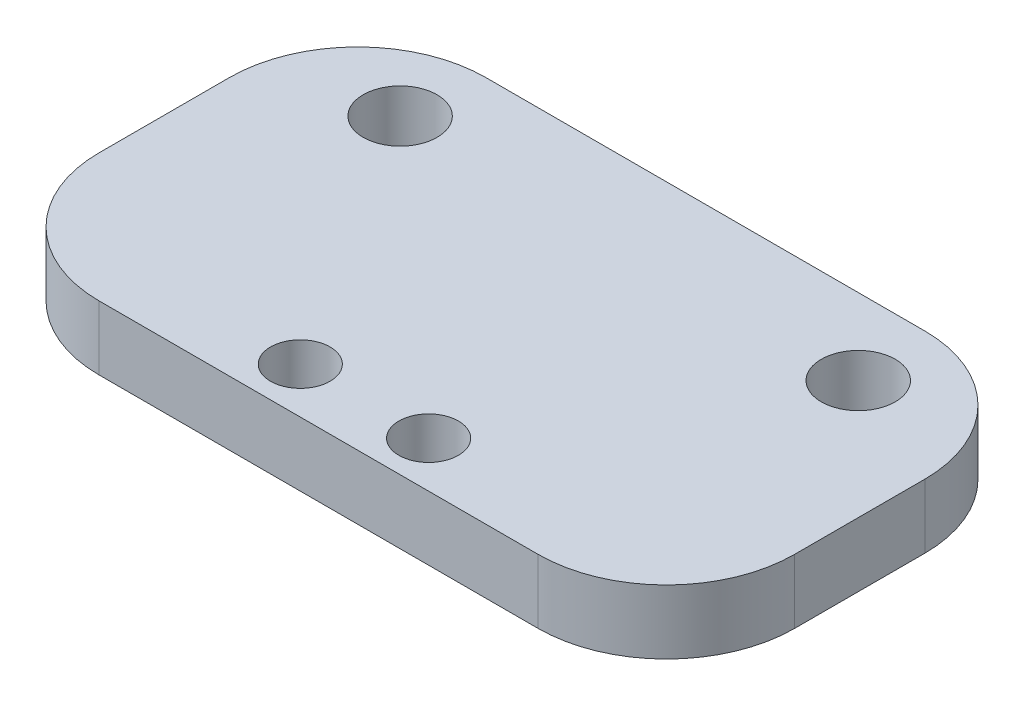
from build123d import *

# Parameters (mm, degrees)
SKETCH1_R      = 1.4732
SKETCH1_R_2    = 1.8288
EXTRUDE1_DEPTH = 3.175


with BuildPart() as part:
    # Sketch1 → Extrude1 (new body)
    with BuildSketch(Plane(origin=(0, 0, 0), x_dir=(1, 0, 0), z_dir=(0, 1, 0))):
        with BuildLine():
            Line((-17.209313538, 34.996011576), (-17.209313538, 35.042064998))
            ThreePointArc((-17.209313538, 35.042064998), (-15.349441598, 39.532193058), (-10.859313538, 41.392064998))
            Line((-10.859313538, 41.392064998), (10.859313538, 41.392064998))
            ThreePointArc((10.859313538, 41.392064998), (15.349441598, 39.532193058), (17.209313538, 35.042064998))
            Line((17.209313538, 35.042064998), (17.209313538, 34.996011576))
            Line((17.209313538, 34.996011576), (17.209313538, 28.599958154))
            ThreePointArc((17.209313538, 28.599958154), (15.349441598, 24.109830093), (10.859313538, 22.249958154))
            Line((10.859313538, 22.249958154), (-10.859313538, 22.249958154))
            ThreePointArc((-10.859313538, 22.249958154), (-15.349441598, 24.109830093), (-17.209313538, 28.599958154))
            Line((-17.209313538, 28.599958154), (-17.209313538, 34.996011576))
        make_face()
        with Locations(Location((-3.175, 24.520410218, 0), (0, 0, 270))):
            Circle(SKETCH1_R, mode=Mode.SUBTRACT)
        with Locations(Location((3.175, 24.520410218, 0), (0, 0, 90))):
            Circle(SKETCH1_R, mode=Mode.SUBTRACT)
        with Locations(Location((-11.335612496, 37.620302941, 0), (0, 0, 270))):
            Circle(SKETCH1_R_2, mode=Mode.SUBTRACT)
        with Locations(Location((11.335612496, 37.620302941, 0), (0, 0, 90))):
            Circle(SKETCH1_R_2, mode=Mode.SUBTRACT)
    extrude(amount=EXTRUDE1_DEPTH)


solid = part.part
